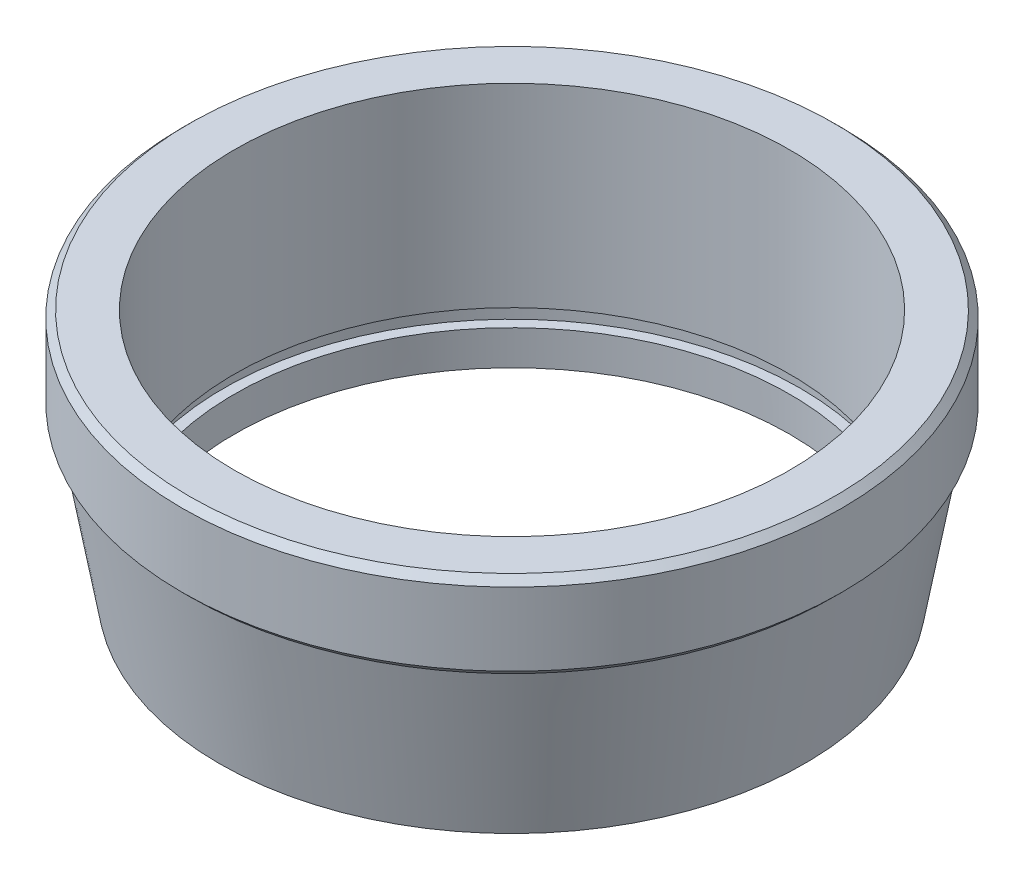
from build123d import *

# Parameters (mm, degrees)
SKICA1_R                 = 9.25
P_IDAT_VYSUNUT_M1_DEPTH  = 4.6
P_IDAT_VYSUNUT_M1_DRAFT  = -10
SKICA2_R                 = 9.5
P_IDAT_VYSUNUT_M2_DEPTH  = 2.5
ZKOSEN_1_SIZE            = 0.2
SKICA3_R                 = 8
ODEBRAT_VYSUNUT_M1_DEPTH = 2.5
ODEBRAT_START            = -4.6
SKICA4_R                 = 8
ODEBRAT_VYSUNUT_M2_DEPTH = 4.6
SKICA5_W                 = 0.3
SKICA5_H                 = 0.5


with BuildPart() as part:
    # Skica1 → P_idat vysunut_m1 (with draft: the straight prism first)
    with BuildSketch(Plane(origin=(0, 0, 0), x_dir=(1, 0, 0), z_dir=(0, 1, 0))):
        Circle(SKICA1_R)
    extrude(amount=-P_IDAT_VYSUNUT_M1_DEPTH)
    # P_idat vysunut_m1: the draft: its side faces are tilted about the plane it starts from
    p_idat_vysunut_m1_sides = [part.faces().sort_by_distance(p)[0] for p in [
        (-9.25, -2.3, 0),
    ]]
    draft(p_idat_vysunut_m1_sides, Plane(origin=(0, 0, 0), x_dir=(1, 0, 0), z_dir=(0, 1, 0)), P_IDAT_VYSUNUT_M1_DRAFT)

    # Skica2 → P_idat vysunut_m2 (add)
    with BuildSketch(Plane(origin=(0, 0, 0), x_dir=(-1, 0, 0), z_dir=(0, 1, 0))):
        with Locations(Location((0, 0, 0), (0, 0, 90))):
            Circle(SKICA2_R)
    extrude(amount=P_IDAT_VYSUNUT_M2_DEPTH)

    # Zkosen_1
    zkosen_1_edges = [part.edges().sort_by_distance(p)[0] for p in [
        (0, 0, -9.5),
        (0, 2.5, -9.5),
    ]]
    chamfer(zkosen_1_edges, length=ZKOSEN_1_SIZE)

    # Skica3 → Odebrat vysunut_m1 (cut)
    with BuildSketch(Plane(origin=(0, 2.5, 0), x_dir=(1, 0, 0), z_dir=(0, 1, 0))):
        with Locations(Location((0, 0, 0), (0, 0, 270))):
            Circle(SKICA3_R)
    extrude(amount=-ODEBRAT_VYSUNUT_M1_DEPTH, mode=Mode.SUBTRACT)

    # Skica4 → Odebrat vysunut_m2 (cut)
    with BuildSketch(Plane.XZ.offset(4.6).offset(ODEBRAT_START)):
        with Locations(Location((0, 0, 0), (0, 0, 90))):
            Circle(SKICA4_R)
    extrude(amount=ODEBRAT_VYSUNUT_M2_DEPTH, mode=Mode.SUBTRACT)

    # Skica5 → Odebrat rotac_1 (revolve, cut)
    with BuildSketch(Plane.XY, mode=Mode.PRIVATE) as odebrat_rotac_1_sk:
        with Locations((-8.15, -3.35)):
            Rectangle(SKICA5_W, SKICA5_H)
    revolve(odebrat_rotac_1_sk.sketch.rotate(Axis((0, 2.5, 0), (0, -1, 0)), 270), axis=Axis((0, 2.5, 0), (0, -1, 0)), mode=Mode.SUBTRACT)


solid = part.part
